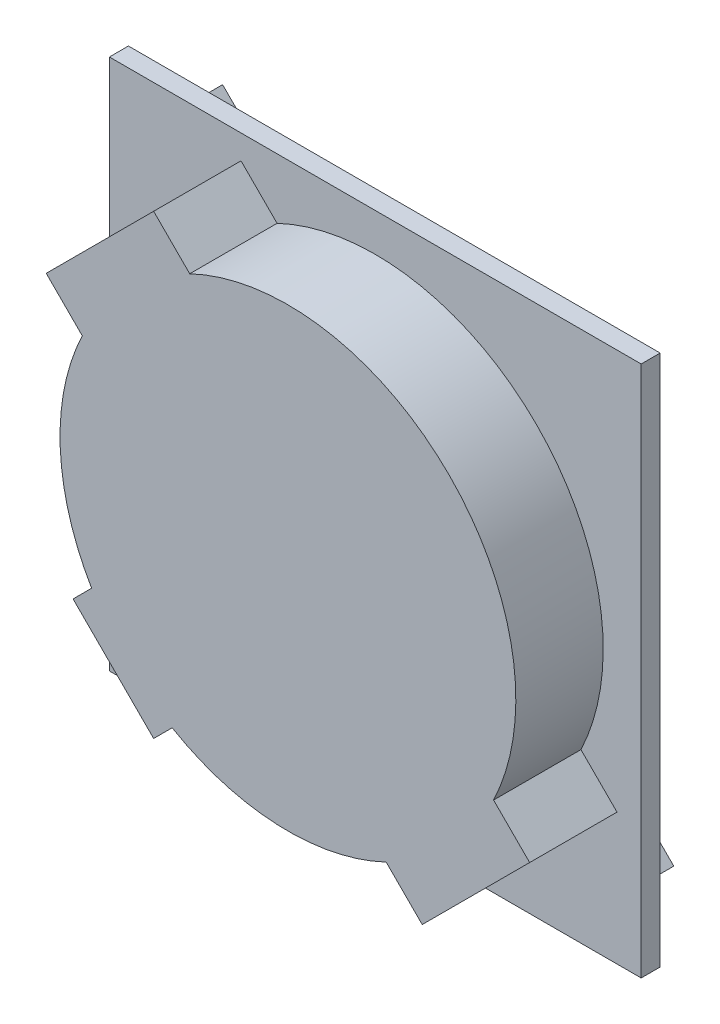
from build123d import *

# Parameters (mm, degrees)
ESQUISSE1_W        = 14
ESQUISSE1_H        = 14
BOSS_EXTRU_1_DEPTH = 0.5
BOSS_EXTRU_2_DEPTH = 2.3
BOSS_EXTRU_3_DEPTH = 1
CHANFREIN1_SIZE    = 1
ESQUISSE4_R        = 1
BOSS_EXTRU_4_DEPTH = 0.5
BOSS_EXTRU_5_DEPTH = 0.5


with BuildPart() as part:
    # Esquisse1 → Boss.-Extru.1 (new body)
    with BuildSketch(Plane.XY):
        with Locations((7, 7)):
            Rectangle(ESQUISSE1_W, ESQUISSE1_H)
    extrude(amount=BOSS_EXTRU_1_DEPTH)

    # Esquisse2 → Boss.-Extru.2 (add)
    with BuildSketch(Plane.XY.offset(0.5)):
        with BuildLine():
            Line((0.636038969, 10.535533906), (1.585786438, 9.585786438))
            ThreePointArc((1.585786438, 9.585786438), (1.00569631, 6.738612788), (1.831420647, 3.95274099))
            Line((1.831420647, 3.95274099), (1.343145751, 3.464466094))
            Line((1.343145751, 3.464466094), (3.464466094, 1.343145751))
            Line((3.464466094, 1.343145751), (3.95274099, 1.831420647))
            ThreePointArc((3.95274099, 1.831420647), (6.738612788, 1.00569631), (9.585786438, 1.585786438))
            Line((9.585786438, 1.585786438), (10.535533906, 0.636038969))
            Line((10.535533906, 0.636038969), (13.363961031, 3.464466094))
            Line((13.363961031, 3.464466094), (12.414213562, 4.414213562))
            ThreePointArc((12.414213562, 4.414213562), (11.242640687, 11.242640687), (4.414213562, 12.414213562))
            Line((4.414213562, 12.414213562), (3.464466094, 13.363961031))
            Line((3.464466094, 13.363961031), (0.636038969, 10.535533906))
        make_face()
    extrude(amount=BOSS_EXTRU_2_DEPTH)

    # Esquisse3 → Boss.-Extru.3 (add)
    with BuildSketch(Plane(origin=(0, 0, 0), x_dir=(-1, 0, 0), z_dir=(0, 0, -1))):
        Polygon((-1.343145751, 9.121320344), (-4.878679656, 12.656854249), (-8.414213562, 9.121320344), (-4.878679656, 5.585786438), align=None)
    extrude(amount=BOSS_EXTRU_3_DEPTH)

    # Chanfrein1
    chanfrein1_edges = [part.edges().sort_by_distance(p)[0] for p in [
        (4.878679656, 12.656854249, -0.5),
        (8.414213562, 9.121320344, -0.5),
        (4.878679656, 5.585786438, -0.5),
        (1.343145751, 9.121320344, -0.5),
    ]]
    chamfer(chanfrein1_edges, length=CHANFREIN1_SIZE)

    # Esquisse4 → Boss.-Extru.4 (add)
    with BuildSketch(Plane(origin=(0, 0, -1), x_dir=(-1, 0, 0), z_dir=(0, 0, -1))):
        with Locations((-4.878679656, 9.121320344)):
            Circle(ESQUISSE4_R)
    extrude(amount=BOSS_EXTRU_4_DEPTH)

    # Esquisse5 → Boss.-Extru.5 (add)
    with BuildSketch(Plane(origin=(0, 0, 0), x_dir=(-1, 0, 0), z_dir=(0, 0, -1))):
        Polygon((-0.141421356, 12.020101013), (-1.979898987, 13.858578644), (-2.545584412, 13.292893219), (-0.707106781, 11.454415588), align=None)
        Polygon((-1.979898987, 0.141421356), (-0.141421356, 1.979898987), (-0.707106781, 2.545584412), (-2.545584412, 0.707106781), align=None)
        Polygon((-13.858578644, 1.979898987), (-12.020101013, 0.141421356), (-11.454415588, 0.707106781), (-13.292893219, 2.545584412), align=None)
    extrude(amount=BOSS_EXTRU_5_DEPTH)


solid = part.part
